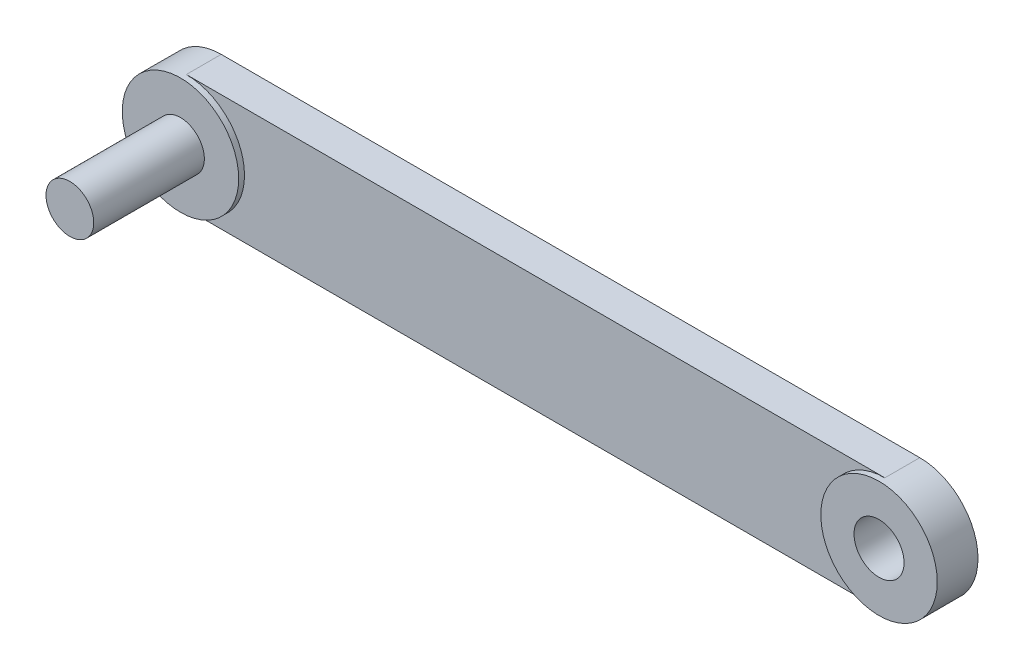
from build123d import *

# Parameters (mm, degrees)
ESQUISSE1_R        = 2.05
ESQUISSE1_R_2      = 2.15
BOSS_EXTRU_1_DEPTH = 3
ESQUISSE2_R        = 5
ESQUISSE2_R_2      = 2.05
ESQUISSE2_R_3      = 2.15
BOSS_EXTRU_2_DEPTH = 0.5
ESQUISSE4_R        = 2.05
BOSS_EXTRU_3_DEPTH = 13


with BuildPart() as part:
    # Esquisse1 → Boss.-Extru.1 (new body)
    with BuildSketch(Plane.XY):
        with BuildLine():
            Line((0, 5), (60, 5))
            ThreePointArc((60, 5), (65, 0), (60, -5))
            Line((60, -5), (0, -5))
            ThreePointArc((0, -5), (-5, 0), (0, 5))
        make_face()
        Circle(ESQUISSE1_R, mode=Mode.SUBTRACT)
        with Locations((60, 0)):
            Circle(ESQUISSE1_R_2, mode=Mode.SUBTRACT)
    extrude(amount=BOSS_EXTRU_1_DEPTH)

    # Esquisse2 → Boss.-Extru.2 (add)
    # profile 1 of 2: a face of its own
    with BuildSketch(Plane.XY.offset(3)):
        with Locations(Location((0, 0, 0), (0, 0, 270))):
            Circle(ESQUISSE2_R)
        Circle(ESQUISSE2_R_2, mode=Mode.SUBTRACT)
    # profile 2 of 2: a face of its own
    with BuildSketch(Plane.XY.offset(3)):
        with Locations(Location((60, 0, 0), (0, 0, 90))):
            Circle(ESQUISSE2_R)
        with Locations((60, 0)):
            Circle(ESQUISSE2_R_3, mode=Mode.SUBTRACT)
    extrude(amount=BOSS_EXTRU_2_DEPTH)

    # Esquisse4 → Boss.-Extru.3 (add)
    with BuildSketch(Plane(origin=(0, 0, 0), x_dir=(-1, 0, 0), z_dir=(0, 0, -1))):
        Circle(ESQUISSE4_R)
    extrude(amount=-BOSS_EXTRU_3_DEPTH)


solid = part.part
